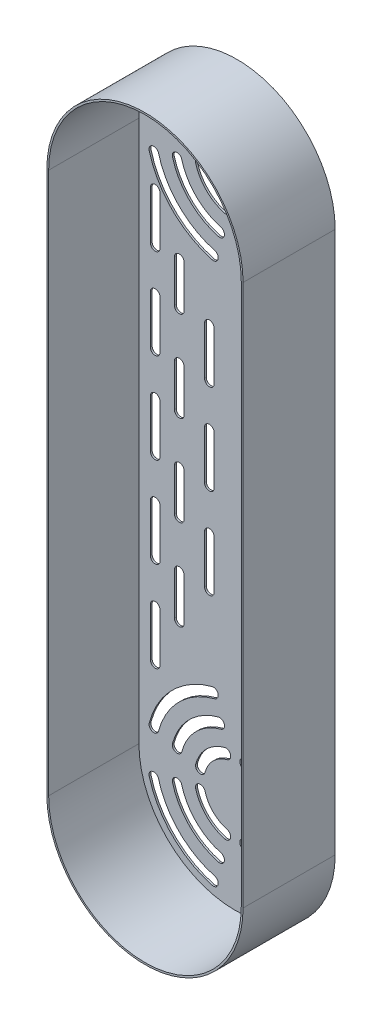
from build123d import *

# Parameters (mm, degrees)
BOSS_EXTRUDE1_DEPTH    = 150
BOSS_EXTRUDE2_START    = 3
BOSS_EXTRUDE2_DEPTH    = 3
CUT_EXTRUDE1_DEPTH     = 10
CIRPATTERN1_COUNT      = 4
LPATTERN1_COUNT        = 2
LPATTERN1_PITCH        = 900
LPATTERN1_COPY_1_DEPTH = 10
LPATTERN1_COPY_2_DEPTH = 10
LPATTERN1_COPY_3_DEPTH = 10
CUT_EXTRUDE2_DEPTH     = 10
LPATTERN2_COUNT        = 5
LPATTERN2_PITCH        = 150
CUT_EXTRUDE3_DEPTH     = 10
LPATTERN3_COUNT        = 4
LPATTERN3_PITCH        = 150
CUT_EXTRUDE4_DEPTH     = 10
LPATTERN4_COUNT        = 3
LPATTERN4_PITCH        = 150
MIRROR1_COPY_1_DEPTH   = 10
MIRROR1_COPY_2_DEPTH   = 10
MIRROR1_COPY_3_DEPTH   = 10
MIRROR1_COPY_4_DEPTH   = 10
MIRROR1_COPY_5_DEPTH   = 10
MIRROR1_COPY_6_DEPTH   = 10
MIRROR1_COPY_7_DEPTH   = 10
MIRROR1_COPY_8_DEPTH   = 10
MIRROR1_COPY_9_DEPTH   = 10


with BuildPart() as part:
    # Sketch1 → Boss-Extrude1 (new body)
    with BuildSketch(Plane.XY):
        with BuildLine():
            Line((-163, 900), (-163, 0))
            ThreePointArc((-163, 0), (0, -163), (163, 0))
            Line((163, 0), (163, 900))
            ThreePointArc((163, 900), (0, 1063), (-163, 900))
        make_face()
        with BuildLine():
            Line((-160, 900), (-160, 0))
            ThreePointArc((-160, 0), (0, -160), (160, 0))
            Line((160, 0), (160, 900))
            ThreePointArc((160, 900), (0, 1060), (-160, 900))
        make_face(mode=Mode.SUBTRACT)
    extrude(amount=BOSS_EXTRUDE1_DEPTH)

    # Sketch2 → Boss-Extrude2 (add)
    with BuildSketch(Plane(origin=(0, 0, 0), x_dir=(-1, 0, 0), z_dir=(0, 0, -1)).offset(BOSS_EXTRUDE2_START)):
        with BuildLine():
            Line((-163, 0), (-163, 900))
            ThreePointArc((-163, 900), (0, 1063), (163, 900))
            Line((163, 900), (163, 0))
            ThreePointArc((163, 0), (0, -163), (-163, 0))
        make_face()
    extrude(amount=-BOSS_EXTRUDE2_DEPTH)

    # Sketch3 → Cut-Extrude1 (cut)
    with BuildSketch(Plane.XY):
        with BuildLine():
            ThreePointArc((38.305218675, -142.957022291), (104.651803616, -104.651803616), (142.957022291, -38.305218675))
            ThreePointArc((142.957022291, -38.305218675), (137.300168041, -28.507259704), (127.50220907, -34.164113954))
            ThreePointArc((127.50220907, -34.164113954), (93.338095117, -93.338095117), (34.164113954, -127.50220907))
            ThreePointArc((34.164113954, -127.50220907), (28.507259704, -137.300168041), (38.305218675, -142.957022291))
        make_face()
        with BuildLine():
            ThreePointArc((27.952456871, -104.319989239), (76.367532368, -76.367532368), (104.319989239, -27.952456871))
            ThreePointArc((104.319989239, -27.952456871), (98.66313499, -18.1544979), (88.865176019, -23.811352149))
            ThreePointArc((88.865176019, -23.811352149), (65.053823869, -65.053823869), (23.811352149, -88.865176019))
            ThreePointArc((23.811352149, -88.865176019), (18.1544979, -98.66313499), (27.952456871, -104.319989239))
        make_face()
        with BuildLine():
            ThreePointArc((17.599695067, -65.682956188), (48.083261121, -48.083261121), (65.682956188, -17.599695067))
            ThreePointArc((65.682956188, -17.599695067), (60.026101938, -7.801736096), (50.228142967, -13.458590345))
            ThreePointArc((50.228142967, -13.458590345), (36.769552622, -36.769552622), (13.458590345, -50.228142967))
            ThreePointArc((13.458590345, -50.228142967), (7.801736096, -60.026101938), (17.599695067, -65.682956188))
        make_face()
    cut_extrude1 = extrude(amount=-CUT_EXTRUDE1_DEPTH, mode=Mode.SUBTRACT)

    # CirPattern1: Cut-Extrude1 ×4 about axis
    cirpattern1_axis = Axis((0, 0, 0), (0, 0, 1))
    for i in range(1, CIRPATTERN1_COUNT):
        add(cut_extrude1.rotate(cirpattern1_axis, i * 360 / CIRPATTERN1_COUNT), mode=Mode.SUBTRACT)

    # LPattern1: Cut-Extrude1 ×2
    with Locations(*[(0, i * LPATTERN1_PITCH, 0) for i in range(1, LPATTERN1_COUNT)]):
        add(cut_extrude1, mode=Mode.SUBTRACT)

    # LPattern1 copy 1 sketch → LPattern1 copy 1 (cut)
    with BuildSketch(Plane(origin=(0, 900, 0), x_dir=(0, 1, 0), z_dir=(0, 0, 1))):
        with BuildLine():
            ThreePointArc((38.305218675, -142.957022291), (104.651803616, -104.651803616), (142.957022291, -38.305218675))
            ThreePointArc((142.957022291, -38.305218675), (137.300168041, -28.507259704), (127.50220907, -34.164113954))
            ThreePointArc((127.50220907, -34.164113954), (93.338095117, -93.338095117), (34.164113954, -127.50220907))
            ThreePointArc((34.164113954, -127.50220907), (28.507259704, -137.300168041), (38.305218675, -142.957022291))
        make_face()
        with BuildLine():
            ThreePointArc((27.952456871, -104.319989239), (76.367532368, -76.367532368), (104.319989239, -27.952456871))
            ThreePointArc((104.319989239, -27.952456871), (98.66313499, -18.1544979), (88.865176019, -23.811352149))
            ThreePointArc((88.865176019, -23.811352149), (65.053823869, -65.053823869), (23.811352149, -88.865176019))
            ThreePointArc((23.811352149, -88.865176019), (18.1544979, -98.66313499), (27.952456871, -104.319989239))
        make_face()
        with BuildLine():
            ThreePointArc((17.599695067, -65.682956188), (48.083261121, -48.083261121), (65.682956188, -17.599695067))
            ThreePointArc((65.682956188, -17.599695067), (60.026101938, -7.801736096), (50.228142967, -13.458590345))
            ThreePointArc((50.228142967, -13.458590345), (36.769552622, -36.769552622), (13.458590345, -50.228142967))
            ThreePointArc((13.458590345, -50.228142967), (7.801736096, -60.026101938), (17.599695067, -65.682956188))
        make_face()
    extrude(amount=-LPATTERN1_COPY_1_DEPTH, mode=Mode.SUBTRACT)

    # LPattern1 copy 2 sketch → LPattern1 copy 2 (cut)
    with BuildSketch(Plane(origin=(0, 900, 0), x_dir=(-1, 0, 0), z_dir=(0, 0, 1))):
        with BuildLine():
            ThreePointArc((38.305218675, -142.957022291), (104.651803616, -104.651803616), (142.957022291, -38.305218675))
            ThreePointArc((142.957022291, -38.305218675), (137.300168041, -28.507259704), (127.50220907, -34.164113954))
            ThreePointArc((127.50220907, -34.164113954), (93.338095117, -93.338095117), (34.164113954, -127.50220907))
            ThreePointArc((34.164113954, -127.50220907), (28.507259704, -137.300168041), (38.305218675, -142.957022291))
        make_face()
        with BuildLine():
            ThreePointArc((27.952456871, -104.319989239), (76.367532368, -76.367532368), (104.319989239, -27.952456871))
            ThreePointArc((104.319989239, -27.952456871), (98.66313499, -18.1544979), (88.865176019, -23.811352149))
            ThreePointArc((88.865176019, -23.811352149), (65.053823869, -65.053823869), (23.811352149, -88.865176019))
            ThreePointArc((23.811352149, -88.865176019), (18.1544979, -98.66313499), (27.952456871, -104.319989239))
        make_face()
        with BuildLine():
            ThreePointArc((17.599695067, -65.682956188), (48.083261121, -48.083261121), (65.682956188, -17.599695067))
            ThreePointArc((65.682956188, -17.599695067), (60.026101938, -7.801736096), (50.228142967, -13.458590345))
            ThreePointArc((50.228142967, -13.458590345), (36.769552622, -36.769552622), (13.458590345, -50.228142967))
            ThreePointArc((13.458590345, -50.228142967), (7.801736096, -60.026101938), (17.599695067, -65.682956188))
        make_face()
    extrude(amount=-LPATTERN1_COPY_2_DEPTH, mode=Mode.SUBTRACT)

    # LPattern1 copy 3 sketch → LPattern1 copy 3 (cut)
    with BuildSketch(Plane(origin=(0, 900, 0), x_dir=(0, -1, 0), z_dir=(0, 0, 1))):
        with BuildLine():
            ThreePointArc((38.305218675, -142.957022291), (104.651803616, -104.651803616), (142.957022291, -38.305218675))
            ThreePointArc((142.957022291, -38.305218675), (137.300168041, -28.507259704), (127.50220907, -34.164113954))
            ThreePointArc((127.50220907, -34.164113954), (93.338095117, -93.338095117), (34.164113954, -127.50220907))
            ThreePointArc((34.164113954, -127.50220907), (28.507259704, -137.300168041), (38.305218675, -142.957022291))
        make_face()
        with BuildLine():
            ThreePointArc((27.952456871, -104.319989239), (76.367532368, -76.367532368), (104.319989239, -27.952456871))
            ThreePointArc((104.319989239, -27.952456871), (98.66313499, -18.1544979), (88.865176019, -23.811352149))
            ThreePointArc((88.865176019, -23.811352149), (65.053823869, -65.053823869), (23.811352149, -88.865176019))
            ThreePointArc((23.811352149, -88.865176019), (18.1544979, -98.66313499), (27.952456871, -104.319989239))
        make_face()
        with BuildLine():
            ThreePointArc((17.599695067, -65.682956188), (48.083261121, -48.083261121), (65.682956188, -17.599695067))
            ThreePointArc((65.682956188, -17.599695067), (60.026101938, -7.801736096), (50.228142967, -13.458590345))
            ThreePointArc((50.228142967, -13.458590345), (36.769552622, -36.769552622), (13.458590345, -50.228142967))
            ThreePointArc((13.458590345, -50.228142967), (7.801736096, -60.026101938), (17.599695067, -65.682956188))
        make_face()
    extrude(amount=-LPATTERN1_COPY_3_DEPTH, mode=Mode.SUBTRACT)

    # Sketch4 → Cut-Extrude2 (cut)
    with BuildSketch(Plane(origin=(0, 0, -3), x_dir=(-1, 0, 0), z_dir=(0, 0, -1))):
        with BuildLine():
            Line((-141, 130), (-141, 210))
            ThreePointArc((-141, 210), (-133, 218), (-125, 210))
            Line((-125, 210), (-125, 130))
            ThreePointArc((-125, 130), (-133, 122), (-141, 130))
        make_face()
    cut_extrude2 = extrude(amount=-CUT_EXTRUDE2_DEPTH, mode=Mode.SUBTRACT)

    # LPattern2: Cut-Extrude2 ×5
    with Locations(*[(0, i * LPATTERN2_PITCH, 0) for i in range(1, LPATTERN2_COUNT)]):
        add(cut_extrude2, mode=Mode.SUBTRACT)

    # Sketch5 → Cut-Extrude3 (cut)
    with BuildSketch(Plane(origin=(0, 0, -3), x_dir=(-1, 0, 0), z_dir=(0, 0, -1))):
        with BuildLine():
            Line((-101, 210), (-101, 280))
            ThreePointArc((-101, 280), (-93, 288), (-85, 280))
            Line((-85, 280), (-85, 210))
            ThreePointArc((-85, 210), (-93, 202), (-101, 210))
        make_face()
    cut_extrude3 = extrude(amount=-CUT_EXTRUDE3_DEPTH, mode=Mode.SUBTRACT)

    # LPattern3: Cut-Extrude3 ×4
    with Locations(*[(0, i * LPATTERN3_PITCH, 0) for i in range(1, LPATTERN3_COUNT)]):
        add(cut_extrude3, mode=Mode.SUBTRACT)

    # Sketch6 → Cut-Extrude4 (cut)
    with BuildSketch(Plane(origin=(0, 0, -3), x_dir=(-1, 0, 0), z_dir=(0, 0, -1))):
        with BuildLine():
            Line((-35, 360), (-35, 280))
            ThreePointArc((-35, 280), (-43, 272), (-51, 280))
            Line((-51, 280), (-51, 360))
            ThreePointArc((-51, 360), (-43, 368), (-35, 360))
        make_face()
    cut_extrude4 = extrude(amount=-CUT_EXTRUDE4_DEPTH, mode=Mode.SUBTRACT)

    # LPattern4: Cut-Extrude4 ×3
    with Locations(*[(0, i * LPATTERN4_PITCH, 0) for i in range(1, LPATTERN4_COUNT)]):
        add(cut_extrude4, mode=Mode.SUBTRACT)

    # Mirror1: Cut-Extrude2, Cut-Extrude3, Cut-Extrude4 across plane
    add(cut_extrude2.mirror(Plane(origin=(0, 0, 0), x_dir=(0, 0, 1), z_dir=(1, 0, 0))), mode=Mode.SUBTRACT)
    add(cut_extrude3.mirror(Plane(origin=(0, 0, 0), x_dir=(0, 0, 1), z_dir=(1, 0, 0))), mode=Mode.SUBTRACT)
    add(cut_extrude4.mirror(Plane(origin=(0, 0, 0), x_dir=(0, 0, 1), z_dir=(1, 0, 0))), mode=Mode.SUBTRACT)

    # Mirror1 copy 1 sketch → Mirror1 copy 1 (cut)
    with BuildSketch(Plane(origin=(0, 150, -3), x_dir=(1, 0, 0), z_dir=(0, 0, -1))):
        with BuildLine():
            Line((-141, -130), (-141, -210))
            ThreePointArc((-141, -210), (-133, -218), (-125, -210))
            Line((-125, -210), (-125, -130))
            ThreePointArc((-125, -130), (-133, -122), (-141, -130))
        make_face()
    extrude(amount=-MIRROR1_COPY_1_DEPTH, mode=Mode.SUBTRACT)

    # Mirror1 copy 2 sketch → Mirror1 copy 2 (cut)
    with BuildSketch(Plane(origin=(0, 300, -3), x_dir=(1, 0, 0), z_dir=(0, 0, -1))):
        with BuildLine():
            Line((-141, -130), (-141, -210))
            ThreePointArc((-141, -210), (-133, -218), (-125, -210))
            Line((-125, -210), (-125, -130))
            ThreePointArc((-125, -130), (-133, -122), (-141, -130))
        make_face()
    extrude(amount=-MIRROR1_COPY_2_DEPTH, mode=Mode.SUBTRACT)

    # Mirror1 copy 3 sketch → Mirror1 copy 3 (cut)
    with BuildSketch(Plane(origin=(0, 450, -3), x_dir=(1, 0, 0), z_dir=(0, 0, -1))):
        with BuildLine():
            Line((-141, -130), (-141, -210))
            ThreePointArc((-141, -210), (-133, -218), (-125, -210))
            Line((-125, -210), (-125, -130))
            ThreePointArc((-125, -130), (-133, -122), (-141, -130))
        make_face()
    extrude(amount=-MIRROR1_COPY_3_DEPTH, mode=Mode.SUBTRACT)

    # Mirror1 copy 4 sketch → Mirror1 copy 4 (cut)
    with BuildSketch(Plane(origin=(0, 600, -3), x_dir=(1, 0, 0), z_dir=(0, 0, -1))):
        with BuildLine():
            Line((-141, -130), (-141, -210))
            ThreePointArc((-141, -210), (-133, -218), (-125, -210))
            Line((-125, -210), (-125, -130))
            ThreePointArc((-125, -130), (-133, -122), (-141, -130))
        make_face()
    extrude(amount=-MIRROR1_COPY_4_DEPTH, mode=Mode.SUBTRACT)

    # Mirror1 copy 5 sketch → Mirror1 copy 5 (cut)
    with BuildSketch(Plane(origin=(0, 150, -3), x_dir=(1, 0, 0), z_dir=(0, 0, -1))):
        with BuildLine():
            Line((-101, -210), (-101, -280))
            ThreePointArc((-101, -280), (-93, -288), (-85, -280))
            Line((-85, -280), (-85, -210))
            ThreePointArc((-85, -210), (-93, -202), (-101, -210))
        make_face()
    extrude(amount=-MIRROR1_COPY_5_DEPTH, mode=Mode.SUBTRACT)

    # Mirror1 copy 6 sketch → Mirror1 copy 6 (cut)
    with BuildSketch(Plane(origin=(0, 300, -3), x_dir=(1, 0, 0), z_dir=(0, 0, -1))):
        with BuildLine():
            Line((-101, -210), (-101, -280))
            ThreePointArc((-101, -280), (-93, -288), (-85, -280))
            Line((-85, -280), (-85, -210))
            ThreePointArc((-85, -210), (-93, -202), (-101, -210))
        make_face()
    extrude(amount=-MIRROR1_COPY_6_DEPTH, mode=Mode.SUBTRACT)

    # Mirror1 copy 7 sketch → Mirror1 copy 7 (cut)
    with BuildSketch(Plane(origin=(0, 450, -3), x_dir=(1, 0, 0), z_dir=(0, 0, -1))):
        with BuildLine():
            Line((-101, -210), (-101, -280))
            ThreePointArc((-101, -280), (-93, -288), (-85, -280))
            Line((-85, -280), (-85, -210))
            ThreePointArc((-85, -210), (-93, -202), (-101, -210))
        make_face()
    extrude(amount=-MIRROR1_COPY_7_DEPTH, mode=Mode.SUBTRACT)

    # Mirror1 copy 8 sketch → Mirror1 copy 8 (cut)
    with BuildSketch(Plane(origin=(0, 150, -3), x_dir=(1, 0, 0), z_dir=(0, 0, -1))):
        with BuildLine():
            Line((-35, -360), (-35, -280))
            ThreePointArc((-35, -280), (-43, -272), (-51, -280))
            Line((-51, -280), (-51, -360))
            ThreePointArc((-51, -360), (-43, -368), (-35, -360))
        make_face()
    extrude(amount=-MIRROR1_COPY_8_DEPTH, mode=Mode.SUBTRACT)

    # Mirror1 copy 9 sketch → Mirror1 copy 9 (cut)
    with BuildSketch(Plane(origin=(0, 300, -3), x_dir=(1, 0, 0), z_dir=(0, 0, -1))):
        with BuildLine():
            Line((-35, -360), (-35, -280))
            ThreePointArc((-35, -280), (-43, -272), (-51, -280))
            Line((-51, -280), (-51, -360))
            ThreePointArc((-51, -360), (-43, -368), (-35, -360))
        make_face()
    extrude(amount=-MIRROR1_COPY_9_DEPTH, mode=Mode.SUBTRACT)


solid = part.part
